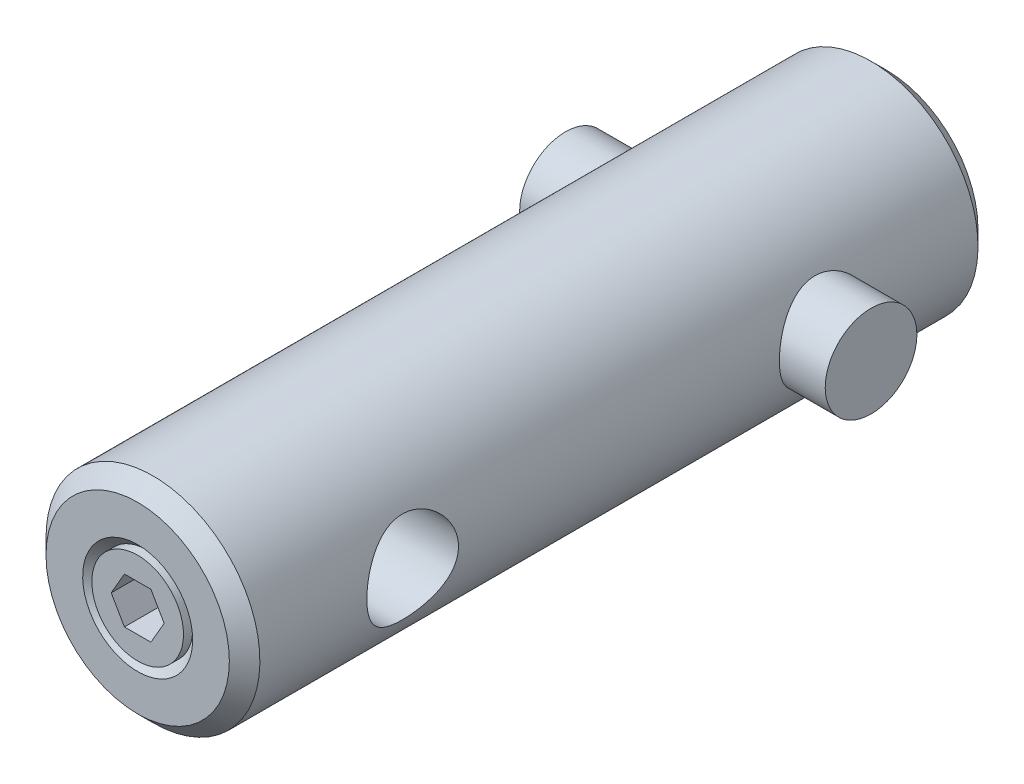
ISO-10303-21;
HEADER;
FILE_DESCRIPTION(('STEP AP214'),'2;1');
FILE_NAME('part.step','',(''),(''),'','','');
FILE_SCHEMA(('AUTOMOTIVE_DESIGN { 1 0 10303 214 1 1 1 1 }'));
ENDSEC;
DATA;
#1=APPLICATION_CONTEXT('core data for automotive mechanical design processes');
#2=APPLICATION_PROTOCOL_DEFINITION('international standard','automotive_design',2000,#1);
#3=PRODUCT_CONTEXT('',#1,'mechanical');
#4=PRODUCT('Part','Part','',(#3));
#5=PRODUCT_RELATED_PRODUCT_CATEGORY('part','',(#4));
#6=PRODUCT_DEFINITION_FORMATION('','',#4);
#7=PRODUCT_DEFINITION_CONTEXT('part definition',#1,'design');
#8=PRODUCT_DEFINITION('design','',#6,#7);
#9=PRODUCT_DEFINITION_SHAPE('','',#8);
#10=(LENGTH_UNIT() NAMED_UNIT(*) SI_UNIT(.MILLI.,.METRE.));
#11=(NAMED_UNIT(*) PLANE_ANGLE_UNIT() SI_UNIT($,.RADIAN.));
#12=(NAMED_UNIT(*) SI_UNIT($,.STERADIAN.) SOLID_ANGLE_UNIT());
#13=UNCERTAINTY_MEASURE_WITH_UNIT(LENGTH_MEASURE(1.E-05),#10,'distance_accuracy_value','');
#14=(GEOMETRIC_REPRESENTATION_CONTEXT(3) GLOBAL_UNCERTAINTY_ASSIGNED_CONTEXT((#13)) GLOBAL_UNIT_ASSIGNED_CONTEXT((#10,
#11,#12)) REPRESENTATION_CONTEXT('',''));
#15=CARTESIAN_POINT('',(0.,0.,0.));
#16=DIRECTION('',(0.,0.,1.));
#17=DIRECTION('',(1.,0.,0.));
#18=AXIS2_PLACEMENT_3D('',#15,#16,#17);
#19=CARTESIAN_POINT('',(0.,0.,1.49999999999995));
#20=DIRECTION('',(0.,0.,-1.));
#21=DIRECTION('',(1.,0.,0.));
#22=AXIS2_PLACEMENT_3D('',#19,#20,#21);
#23=CYLINDRICAL_SURFACE('',#22,1.5);
#24=CARTESIAN_POINT('',(0.,0.,5.5));
#25=DIRECTION('',(0.,0.,-1.));
#26=DIRECTION('',(1.,0.,0.));
#27=AXIS2_PLACEMENT_3D('',#24,#25,#26);
#28=CIRCLE('',#27,1.5);
#29=CARTESIAN_POINT('',(1.5,0.,5.5));
#30=VERTEX_POINT('',#29);
#31=EDGE_CURVE('E9',#30,#30,#28,.T.);
#32=ORIENTED_EDGE('',*,*,#31,.T.);
#33=EDGE_LOOP('',(#32));
#34=FACE_BOUND('',#33,.T.);
#35=CARTESIAN_POINT('',(0.,0.,5.2));
#36=DIRECTION('',(0.,0.,1.));
#37=DIRECTION('',(0.,-1.,0.));
#38=AXIS2_PLACEMENT_3D('',#35,#36,#37);
#39=CIRCLE('',#38,1.5);
#40=CARTESIAN_POINT('',(0.,-1.5,5.2));
#41=VERTEX_POINT('',#40);
#42=EDGE_CURVE('E17',#41,#41,#39,.T.);
#43=ORIENTED_EDGE('',*,*,#42,.T.);
#44=EDGE_LOOP('',(#43));
#45=FACE_BOUND('',#44,.T.);
#46=ADVANCED_FACE('F14',(#34,#45),#23,.T.);
#47=CARTESIAN_POINT('',(1.5,0.,5.5));
#48=DIRECTION('',(0.,0.,1.));
#49=DIRECTION('',(-1.,0.,0.));
#50=AXIS2_PLACEMENT_3D('',#47,#48,#49);
#51=PLANE('',#50);
#52=DIRECTION('',(0.5,0.866025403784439,0.));
#53=VECTOR('',#52,1.);
#54=CARTESIAN_POINT('',(0.43301270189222,-0.75,5.5));
#55=LINE('',#54,#53);
#56=CARTESIAN_POINT('',(0.43301270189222,-0.75,5.5));
#57=VERTEX_POINT('',#56);
#58=CARTESIAN_POINT('',(0.86602540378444,0.,5.5));
#59=VERTEX_POINT('',#58);
#60=EDGE_CURVE('E37',#57,#59,#55,.T.);
#61=ORIENTED_EDGE('',*,*,#60,.F.);
#62=DIRECTION('',(1.,0.,0.));
#63=VECTOR('',#62,1.);
#64=CARTESIAN_POINT('',(-0.43301270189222,-0.75,5.5));
#65=LINE('',#64,#63);
#66=CARTESIAN_POINT('',(-0.43301270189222,-0.75,5.5));
#67=VERTEX_POINT('',#66);
#68=EDGE_CURVE('E241',#67,#57,#65,.T.);
#69=ORIENTED_EDGE('',*,*,#68,.F.);
#70=DIRECTION('',(0.5,-0.866025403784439,0.));
#71=VECTOR('',#70,1.);
#72=CARTESIAN_POINT('',(-0.86602540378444,0.,5.5));
#73=LINE('',#72,#71);
#74=CARTESIAN_POINT('',(-0.86602540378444,0.,5.5));
#75=VERTEX_POINT('',#74);
#76=EDGE_CURVE('E265',#75,#67,#73,.T.);
#77=ORIENTED_EDGE('',*,*,#76,.F.);
#78=DIRECTION('',(-0.5,-0.866025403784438,0.));
#79=VECTOR('',#78,1.);
#80=CARTESIAN_POINT('',(-0.43301270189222,0.75,5.5));
#81=LINE('',#80,#79);
#82=CARTESIAN_POINT('',(-0.43301270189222,0.75,5.5));
#83=VERTEX_POINT('',#82);
#84=EDGE_CURVE('E262',#83,#75,#81,.T.);
#85=ORIENTED_EDGE('',*,*,#84,.F.);
#86=DIRECTION('',(-1.,0.,0.));
#87=VECTOR('',#86,1.);
#88=CARTESIAN_POINT('',(0.43301270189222,0.75,5.5));
#89=LINE('',#88,#87);
#90=CARTESIAN_POINT('',(0.43301270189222,0.75,5.5));
#91=VERTEX_POINT('',#90);
#92=EDGE_CURVE('E259',#91,#83,#89,.T.);
#93=ORIENTED_EDGE('',*,*,#92,.F.);
#94=DIRECTION('',(-0.5,0.866025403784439,0.));
#95=VECTOR('',#94,1.);
#96=CARTESIAN_POINT('',(0.86602540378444,0.,5.5));
#97=LINE('',#96,#95);
#98=EDGE_CURVE('E221',#59,#91,#97,.T.);
#99=ORIENTED_EDGE('',*,*,#98,.F.);
#100=EDGE_LOOP('',(#61,#69,#77,#85,#93,#99));
#101=FACE_BOUND('',#100,.T.);
#102=ORIENTED_EDGE('',*,*,#31,.F.);
#103=EDGE_LOOP('',(#102));
#104=FACE_BOUND('',#103,.T.);
#105=ADVANCED_FACE('F207',(#101,#104),#51,.T.);
#106=CARTESIAN_POINT('',(0.43301270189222,-0.75,3.5));
#107=DIRECTION('',(0.866025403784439,-0.5,0.));
#108=DIRECTION('',(0.5,0.866025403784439,0.));
#109=AXIS2_PLACEMENT_3D('',#106,#107,#108);
#110=PLANE('',#109);
#111=ORIENTED_EDGE('',*,*,#60,.T.);
#112=DIRECTION('',(0.,0.,1.));
#113=VECTOR('',#112,1.);
#114=CARTESIAN_POINT('',(0.86602540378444,0.,3.5));
#115=LINE('',#114,#113);
#116=CARTESIAN_POINT('',(0.86602540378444,0.,3.5));
#117=VERTEX_POINT('',#116);
#118=EDGE_CURVE('E255',#117,#59,#115,.T.);
#119=ORIENTED_EDGE('',*,*,#118,.F.);
#120=DIRECTION('',(0.5,0.866025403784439,0.));
#121=VECTOR('',#120,1.);
#122=CARTESIAN_POINT('',(0.43301270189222,-0.75,3.5));
#123=LINE('',#122,#121);
#124=CARTESIAN_POINT('',(0.43301270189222,-0.75,3.5));
#125=VERTEX_POINT('',#124);
#126=EDGE_CURVE('E237',#125,#117,#123,.T.);
#127=ORIENTED_EDGE('',*,*,#126,.F.);
#128=DIRECTION('',(0.,0.,1.));
#129=VECTOR('',#128,1.);
#130=CARTESIAN_POINT('',(0.43301270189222,-0.75,3.5));
#131=LINE('',#130,#129);
#132=EDGE_CURVE('E22',#125,#57,#131,.T.);
#133=ORIENTED_EDGE('',*,*,#132,.T.);
#134=EDGE_LOOP('',(#111,#119,#127,#133));
#135=FACE_BOUND('',#134,.T.);
#136=ADVANCED_FACE('F213',(#135),#110,.F.);
#137=CARTESIAN_POINT('',(-0.43301270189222,-0.75,3.5));
#138=DIRECTION('',(0.,-1.,0.));
#139=DIRECTION('',(1.,0.,0.));
#140=AXIS2_PLACEMENT_3D('',#137,#138,#139);
#141=PLANE('',#140);
#142=ORIENTED_EDGE('',*,*,#68,.T.);
#143=ORIENTED_EDGE('',*,*,#132,.F.);
#144=DIRECTION('',(1.,0.,0.));
#145=VECTOR('',#144,1.);
#146=CARTESIAN_POINT('',(-0.43301270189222,-0.75,3.5));
#147=LINE('',#146,#145);
#148=CARTESIAN_POINT('',(-0.43301270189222,-0.75,3.5));
#149=VERTEX_POINT('',#148);
#150=EDGE_CURVE('E253',#149,#125,#147,.T.);
#151=ORIENTED_EDGE('',*,*,#150,.F.);
#152=DIRECTION('',(0.,0.,1.));
#153=VECTOR('',#152,1.);
#154=CARTESIAN_POINT('',(-0.43301270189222,-0.75,3.5));
#155=LINE('',#154,#153);
#156=EDGE_CURVE('E271',#149,#67,#155,.T.);
#157=ORIENTED_EDGE('',*,*,#156,.T.);
#158=EDGE_LOOP('',(#142,#143,#151,#157));
#159=FACE_BOUND('',#158,.T.);
#160=ADVANCED_FACE('F297',(#159),#141,.F.);
#161=CARTESIAN_POINT('',(-0.866025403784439,0.,3.5));
#162=DIRECTION('',(-0.866025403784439,-0.5,0.));
#163=DIRECTION('',(0.5,-0.866025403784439,0.));
#164=AXIS2_PLACEMENT_3D('',#161,#162,#163);
#165=PLANE('',#164);
#166=ORIENTED_EDGE('',*,*,#76,.T.);
#167=ORIENTED_EDGE('',*,*,#156,.F.);
#168=DIRECTION('',(0.5,-0.866025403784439,0.));
#169=VECTOR('',#168,1.);
#170=CARTESIAN_POINT('',(-0.866025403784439,0.,3.5));
#171=LINE('',#170,#169);
#172=CARTESIAN_POINT('',(-0.866025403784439,0.,3.5));
#173=VERTEX_POINT('',#172);
#174=EDGE_CURVE('E250',#173,#149,#171,.T.);
#175=ORIENTED_EDGE('',*,*,#174,.F.);
#176=DIRECTION('',(0.,0.,1.));
#177=VECTOR('',#176,1.);
#178=CARTESIAN_POINT('',(-0.866025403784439,0.,3.5));
#179=LINE('',#178,#177);
#180=EDGE_CURVE('E273',#173,#75,#179,.T.);
#181=ORIENTED_EDGE('',*,*,#180,.T.);
#182=EDGE_LOOP('',(#166,#167,#175,#181));
#183=FACE_BOUND('',#182,.T.);
#184=ADVANCED_FACE('F299',(#183),#165,.F.);
#185=CARTESIAN_POINT('',(-0.43301270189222,0.75,3.5));
#186=DIRECTION('',(-0.866025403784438,0.5,0.));
#187=DIRECTION('',(-0.5,-0.866025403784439,0.));
#188=AXIS2_PLACEMENT_3D('',#185,#186,#187);
#189=PLANE('',#188);
#190=ORIENTED_EDGE('',*,*,#84,.T.);
#191=ORIENTED_EDGE('',*,*,#180,.F.);
#192=DIRECTION('',(-0.5,-0.866025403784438,0.));
#193=VECTOR('',#192,1.);
#194=CARTESIAN_POINT('',(-0.43301270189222,0.75,3.5));
#195=LINE('',#194,#193);
#196=CARTESIAN_POINT('',(-0.43301270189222,0.75,3.5));
#197=VERTEX_POINT('',#196);
#198=EDGE_CURVE('E247',#197,#173,#195,.T.);
#199=ORIENTED_EDGE('',*,*,#198,.F.);
#200=DIRECTION('',(0.,0.,1.));
#201=VECTOR('',#200,1.);
#202=CARTESIAN_POINT('',(-0.43301270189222,0.75,3.5));
#203=LINE('',#202,#201);
#204=EDGE_CURVE('E275',#197,#83,#203,.T.);
#205=ORIENTED_EDGE('',*,*,#204,.T.);
#206=EDGE_LOOP('',(#190,#191,#199,#205));
#207=FACE_BOUND('',#206,.T.);
#208=ADVANCED_FACE('F302',(#207),#189,.F.);
#209=CARTESIAN_POINT('',(0.43301270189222,0.75,3.5));
#210=DIRECTION('',(0.,1.,0.));
#211=DIRECTION('',(-1.,0.,0.));
#212=AXIS2_PLACEMENT_3D('',#209,#210,#211);
#213=PLANE('',#212);
#214=ORIENTED_EDGE('',*,*,#92,.T.);
#215=ORIENTED_EDGE('',*,*,#204,.F.);
#216=DIRECTION('',(-1.,0.,0.));
#217=VECTOR('',#216,1.);
#218=CARTESIAN_POINT('',(0.43301270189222,0.75,3.5));
#219=LINE('',#218,#217);
#220=CARTESIAN_POINT('',(0.43301270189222,0.75,3.5));
#221=VERTEX_POINT('',#220);
#222=EDGE_CURVE('E244',#221,#197,#219,.T.);
#223=ORIENTED_EDGE('',*,*,#222,.F.);
#224=DIRECTION('',(0.,0.,1.));
#225=VECTOR('',#224,1.);
#226=CARTESIAN_POINT('',(0.43301270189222,0.75,3.5));
#227=LINE('',#226,#225);
#228=EDGE_CURVE('E277',#221,#91,#227,.T.);
#229=ORIENTED_EDGE('',*,*,#228,.T.);
#230=EDGE_LOOP('',(#214,#215,#223,#229));
#231=FACE_BOUND('',#230,.T.);
#232=ADVANCED_FACE('F290',(#231),#213,.F.);
#233=CARTESIAN_POINT('',(0.86602540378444,0.,3.5));
#234=DIRECTION('',(0.866025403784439,0.5,0.));
#235=DIRECTION('',(-0.5,0.866025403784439,0.));
#236=AXIS2_PLACEMENT_3D('',#233,#234,#235);
#237=PLANE('',#236);
#238=ORIENTED_EDGE('',*,*,#98,.T.);
#239=ORIENTED_EDGE('',*,*,#228,.F.);
#240=DIRECTION('',(-0.5,0.866025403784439,0.));
#241=VECTOR('',#240,1.);
#242=CARTESIAN_POINT('',(0.86602540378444,0.,3.5));
#243=LINE('',#242,#241);
#244=EDGE_CURVE('E240',#117,#221,#243,.T.);
#245=ORIENTED_EDGE('',*,*,#244,.F.);
#246=ORIENTED_EDGE('',*,*,#118,.T.);
#247=EDGE_LOOP('',(#238,#239,#245,#246));
#248=FACE_BOUND('',#247,.T.);
#249=ADVANCED_FACE('F282',(#248),#237,.F.);
#250=CARTESIAN_POINT('',(0.86602540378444,0.,3.5));
#251=DIRECTION('',(0.,0.,1.));
#252=DIRECTION('',(0.,-1.,0.));
#253=AXIS2_PLACEMENT_3D('',#250,#251,#252);
#254=PLANE('',#253);
#255=ORIENTED_EDGE('',*,*,#126,.T.);
#256=ORIENTED_EDGE('',*,*,#244,.T.);
#257=ORIENTED_EDGE('',*,*,#222,.T.);
#258=ORIENTED_EDGE('',*,*,#198,.T.);
#259=ORIENTED_EDGE('',*,*,#174,.T.);
#260=ORIENTED_EDGE('',*,*,#150,.T.);
#261=EDGE_LOOP('',(#255,#256,#257,#258,#259,#260));
#262=FACE_BOUND('',#261,.T.);
#263=ADVANCED_FACE('F294',(#262),#254,.T.);
#264=CARTESIAN_POINT('',(-5.,0.,-13.5));
#265=DIRECTION('',(1.,0.,0.));
#266=DIRECTION('',(0.,1.,0.));
#267=AXIS2_PLACEMENT_3D('',#264,#265,#266);
#268=CYLINDRICAL_SURFACE('',#267,1.5);
#269=CARTESIAN_POINT('',(-5.,0.,-13.5));
#270=DIRECTION('',(-1.,0.,0.));
#271=DIRECTION('',(0.,-1.,0.));
#272=AXIS2_PLACEMENT_3D('',#269,#270,#271);
#273=CIRCLE('',#272,1.5);
#274=CARTESIAN_POINT('',(-5.,-1.5,-13.5));
#275=VERTEX_POINT('',#274);
#276=EDGE_CURVE('E341',#275,#275,#273,.T.);
#277=ORIENTED_EDGE('',*,*,#276,.F.);
#278=EDGE_LOOP('',(#277));
#279=FACE_BOUND('',#278,.T.);
#280=CARTESIAN_POINT('',(-3.16227766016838,1.5,-13.5));
#281=CARTESIAN_POINT('',(-3.16228717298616,1.49999038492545,-13.4202310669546));
#282=CARTESIAN_POINT('',(-3.16534018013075,1.49359660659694,-13.3403418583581));
#283=CARTESIAN_POINT('',(-3.17716042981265,1.46827542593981,-13.1828833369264));
#284=CARTESIAN_POINT('',(-3.18594276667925,1.44931491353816,-13.1053207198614));
#285=CARTESIAN_POINT('',(-3.20802619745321,1.399748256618,-12.9550840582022));
#286=CARTESIAN_POINT('',(-3.22130811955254,1.36919145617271,-12.8823908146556));
#287=CARTESIAN_POINT('',(-3.25086693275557,1.29744502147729,-12.7431820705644));
#288=CARTESIAN_POINT('',(-3.26714323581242,1.25625747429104,-12.6766653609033));
#289=CARTESIAN_POINT('',(-3.3020556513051,1.16151711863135,-12.5472750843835));
#290=CARTESIAN_POINT('',(-3.32077467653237,1.10737213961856,-12.4848572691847));
#291=CARTESIAN_POINT('',(-3.35778390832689,0.989495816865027,-12.3696486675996));
#292=CARTESIAN_POINT('',(-3.37607394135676,0.925760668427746,-12.3168617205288));
#293=CARTESIAN_POINT('',(-3.41118222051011,0.786887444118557,-12.2200404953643));
#294=CARTESIAN_POINT('',(-3.4278929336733,0.71135772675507,-12.1765254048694));
#295=CARTESIAN_POINT('',(-3.4569371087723,0.553203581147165,-12.1030178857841));
#296=CARTESIAN_POINT('',(-3.46927262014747,0.470582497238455,-12.0730191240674));
#297=CARTESIAN_POINT('',(-3.48758735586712,0.305382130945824,-12.0290674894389));
#298=CARTESIAN_POINT('',(-3.49387724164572,0.223047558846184,-12.0143269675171));
#299=CARTESIAN_POINT('',(-3.50052462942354,0.0568497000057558,-11.9987586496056));
#300=CARTESIAN_POINT('',(-3.50088468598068,-0.0270129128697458,-11.9979248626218));
#301=CARTESIAN_POINT('',(-3.49581016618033,-0.188134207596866,-12.0097951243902));
#302=CARTESIAN_POINT('',(-3.49074679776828,-0.265470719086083,-12.0216318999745));
#303=CARTESIAN_POINT('',(-3.47591102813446,-0.416935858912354,-12.0570120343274));
#304=CARTESIAN_POINT('',(-3.46613827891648,-0.491064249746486,-12.0805562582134));
#305=CARTESIAN_POINT('',(-3.44263346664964,-0.635378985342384,-12.1389532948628));
#306=CARTESIAN_POINT('',(-3.42884310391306,-0.705487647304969,-12.1739736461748));
#307=CARTESIAN_POINT('',(-3.39863837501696,-0.839017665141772,-12.2541586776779));
#308=CARTESIAN_POINT('',(-3.38222306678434,-0.902436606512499,-12.2993270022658));
#309=CARTESIAN_POINT('',(-3.34696895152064,-1.02577392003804,-12.402404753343));
#310=CARTESIAN_POINT('',(-3.32804069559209,-1.08508648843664,-12.4610094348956));
#311=CARTESIAN_POINT('',(-3.29078815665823,-1.19331308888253,-12.5873514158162));
#312=CARTESIAN_POINT('',(-3.27246413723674,-1.24222263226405,-12.655092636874));
#313=CARTESIAN_POINT('',(-3.23783417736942,-1.32993971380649,-12.8008899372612));
#314=CARTESIAN_POINT('',(-3.22162619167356,-1.36831384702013,-12.879232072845));
#315=CARTESIAN_POINT('',(-3.19424697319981,-1.43107385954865,-13.042144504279));
#316=CARTESIAN_POINT('',(-3.18307189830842,-1.4554704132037,-13.1267099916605));
#317=CARTESIAN_POINT('',(-3.16799275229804,-1.48799335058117,-13.2935863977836));
#318=CARTESIAN_POINT('',(-3.16364898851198,-1.49710640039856,-13.3756644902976));
#319=CARTESIAN_POINT('',(-3.16146494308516,-1.50171565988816,-13.5402744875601));
#320=CARTESIAN_POINT('',(-3.16362218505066,-1.49721705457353,-13.6228062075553));
#321=CARTESIAN_POINT('',(-3.17374071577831,-1.47563239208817,-13.7799312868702));
#322=CARTESIAN_POINT('',(-3.18128847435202,-1.45944230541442,-13.8546778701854));
#323=CARTESIAN_POINT('',(-3.20079786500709,-1.41614006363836,-14.0003227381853));
#324=CARTESIAN_POINT('',(-3.21276056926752,-1.38902525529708,-14.0712200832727));
#325=CARTESIAN_POINT('',(-3.24038333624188,-1.32334189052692,-14.210604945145));
#326=CARTESIAN_POINT('',(-3.25618154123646,-1.28432659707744,-14.2788536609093));
#327=CARTESIAN_POINT('',(-3.28950916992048,-1.19638562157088,-14.4081753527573));
#328=CARTESIAN_POINT('',(-3.3070393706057,-1.14745548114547,-14.4692450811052));
#329=CARTESIAN_POINT('',(-3.34369698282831,-1.03605747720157,-14.5880144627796));
#330=CARTESIAN_POINT('',(-3.36283055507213,-0.972781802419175,-14.6449576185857));
#331=CARTESIAN_POINT('',(-3.39913473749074,-0.837142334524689,-14.7475671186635));
#332=CARTESIAN_POINT('',(-3.41630515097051,-0.764777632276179,-14.7932323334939));
#333=CARTESIAN_POINT('',(-3.44690719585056,-0.612290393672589,-14.8720413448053));
#334=CARTESIAN_POINT('',(-3.46032004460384,-0.532131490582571,-14.9051225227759));
#335=CARTESIAN_POINT('',(-3.48173830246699,-0.366659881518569,-14.9570748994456));
#336=CARTESIAN_POINT('',(-3.48974713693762,-0.281350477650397,-14.9759551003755));
#337=CARTESIAN_POINT('',(-3.49904040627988,-0.114740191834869,-14.9977887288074));
#338=CARTESIAN_POINT('',(-3.50077418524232,-0.0336030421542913,-15.0018069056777));
#339=CARTESIAN_POINT('',(-3.49858700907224,0.128169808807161,-14.9967022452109));
#340=CARTESIAN_POINT('',(-3.49466715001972,0.208805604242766,-14.9875819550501));
#341=CARTESIAN_POINT('',(-3.48185611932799,0.364022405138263,-14.9572232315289));
#342=CARTESIAN_POINT('',(-3.47316550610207,0.438716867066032,-14.9364730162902));
#343=CARTESIAN_POINT('',(-3.45179100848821,0.583524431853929,-14.8839919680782));
#344=CARTESIAN_POINT('',(-3.43910638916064,0.653636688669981,-14.852259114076));
#345=CARTESIAN_POINT('',(-3.41024047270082,0.790820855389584,-14.777104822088));
#346=CARTESIAN_POINT('',(-3.39392604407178,0.857608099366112,-14.7332161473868));
#347=CARTESIAN_POINT('',(-3.35970811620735,0.983159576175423,-14.6356600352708));
#348=CARTESIAN_POINT('',(-3.34180398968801,1.04192061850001,-14.5819887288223));
#349=CARTESIAN_POINT('',(-3.30477972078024,1.15419921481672,-14.4618044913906));
#350=CARTESIAN_POINT('',(-3.28566570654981,1.20702595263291,-14.3946419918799));
#351=CARTESIAN_POINT('',(-3.24969238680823,1.30078077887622,-14.2518407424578));
#352=CARTESIAN_POINT('',(-3.23283439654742,1.34170194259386,-14.1761970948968));
#353=CARTESIAN_POINT('',(-3.20355631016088,1.41018371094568,-14.0184264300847));
#354=CARTESIAN_POINT('',(-3.19112824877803,1.43776832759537,-13.9363113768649));
#355=CARTESIAN_POINT('',(-3.17252771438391,1.47837340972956,-13.7680448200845));
#356=CARTESIAN_POINT('',(-3.16633426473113,1.49144272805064,-13.6819078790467));
#357=CARTESIAN_POINT('',(-3.16275406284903,1.49899243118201,-13.5636011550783));
#358=CARTESIAN_POINT('',(-3.16227386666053,1.50000383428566,-13.5318101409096));
#359=CARTESIAN_POINT('',(-3.16227766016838,1.5,-13.5));
#360=B_SPLINE_CURVE_WITH_KNOTS('',3,(#280,#281,#282,#283,#284,#285,#286,#287,#288,#289,#290,
#291,#292,#293,#294,#295,#296,#297,#298,#299,#300,#301,#302,#303,#304,#305,#306,#307,#308,#309,
#310,#311,#312,#313,#314,#315,#316,#317,#318,#319,#320,#321,#322,#323,#324,#325,#326,#327,#328,
#329,#330,#331,#332,#333,#334,#335,#336,#337,#338,#339,#340,#341,#342,#343,#344,#345,#346,#347,
#348,#349,#350,#351,#352,#353,#354,#355,#356,#357,#358,#359),.UNSPECIFIED.,.T.,.F.,(4,2,2,2,2,2,
2,2,2,2,2,2,2,2,2,2,2,2,2,2,2,2,2,2,2,2,2,2,2,2,2,2,2,2,2,2,2,2,2,4),(0.,0.239211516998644,
0.479055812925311,0.717890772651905,0.95667887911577,1.20974703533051,1.46291585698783,
1.7278208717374,1.992601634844,2.24290515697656,2.49310084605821,2.72720452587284,
2.96132550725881,3.19902917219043,3.43681833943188,3.69219429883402,3.94768022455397,
4.21248245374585,4.47708218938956,4.72382987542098,4.97048358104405,5.20000580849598,
5.42958381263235,5.66914358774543,5.90881132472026,6.16934837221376,6.42991150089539,
6.69175474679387,6.95343186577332,7.1959527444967,7.43842661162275,7.67141114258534,
7.90443857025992,8.14809791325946,8.39185383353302,8.6533139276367,8.91492579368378,
9.17606486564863,9.43632235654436,9.53171478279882),.UNSPECIFIED.);
#361=CARTESIAN_POINT('',(-3.16227766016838,1.5,-13.5));
#362=VERTEX_POINT('',#361);
#363=EDGE_CURVE('E224',#362,#362,#360,.T.);
#364=ORIENTED_EDGE('',*,*,#363,.F.);
#365=EDGE_LOOP('',(#364));
#366=FACE_BOUND('',#365,.T.);
#367=ADVANCED_FACE('F326',(#279,#366),#268,.T.);
#368=CARTESIAN_POINT('',(-5.,0.,-13.5));
#369=DIRECTION('',(-1.,0.,0.));
#370=DIRECTION('',(0.,-1.,0.));
#371=AXIS2_PLACEMENT_3D('',#368,#369,#370);
#372=PLANE('',#371);
#373=ORIENTED_EDGE('',*,*,#276,.T.);
#374=EDGE_LOOP('',(#373));
#375=FACE_BOUND('',#374,.T.);
#376=ADVANCED_FACE('F330',(#375),#372,.T.);
#377=CARTESIAN_POINT('',(0.,0.,5.5));
#378=DIRECTION('',(0.,0.,1.));
#379=DIRECTION('',(0.,1.,0.));
#380=AXIS2_PLACEMENT_3D('',#377,#378,#379);
#381=CONICAL_SURFACE('',#380,1.8,0.785398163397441);
#382=ORIENTED_EDGE('',*,*,#42,.F.);
#383=EDGE_LOOP('',(#382));
#384=FACE_BOUND('',#383,.T.);
#385=CARTESIAN_POINT('',(0.,0.,5.5));
#386=DIRECTION('',(0.,0.,1.));
#387=DIRECTION('',(0.,1.,0.));
#388=AXIS2_PLACEMENT_3D('',#385,#386,#387);
#389=CIRCLE('',#388,1.8);
#390=CARTESIAN_POINT('',(0.,1.8,5.5));
#391=VERTEX_POINT('',#390);
#392=EDGE_CURVE('E161',#391,#391,#389,.T.);
#393=ORIENTED_EDGE('',*,*,#392,.T.);
#394=EDGE_LOOP('',(#393));
#395=FACE_BOUND('',#394,.T.);
#396=ADVANCED_FACE('F389',(#384,#395),#381,.F.);
#397=CARTESIAN_POINT('',(0.,0.,-19.));
#398=DIRECTION('',(0.,0.,-1.));
#399=DIRECTION('',(0.,-1.,0.));
#400=AXIS2_PLACEMENT_3D('',#397,#398,#399);
#401=CONICAL_SURFACE('',#400,1.8,0.785398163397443);
#402=CARTESIAN_POINT('',(0.,0.,-18.7));
#403=DIRECTION('',(0.,0.,-1.));
#404=DIRECTION('',(0.,1.,0.));
#405=AXIS2_PLACEMENT_3D('',#402,#403,#404);
#406=CIRCLE('',#405,1.5);
#407=CARTESIAN_POINT('',(0.,1.5,-18.7));
#408=VERTEX_POINT('',#407);
#409=EDGE_CURVE('E220',#408,#408,#406,.T.);
#410=ORIENTED_EDGE('',*,*,#409,.F.);
#411=EDGE_LOOP('',(#410));
#412=FACE_BOUND('',#411,.T.);
#413=CARTESIAN_POINT('',(0.,0.,-19.));
#414=DIRECTION('',(0.,0.,-1.));
#415=DIRECTION('',(0.,-1.,0.));
#416=AXIS2_PLACEMENT_3D('',#413,#414,#415);
#417=CIRCLE('',#416,1.8);
#418=CARTESIAN_POINT('',(0.,-1.8,-19.));
#419=VERTEX_POINT('',#418);
#420=EDGE_CURVE('E164',#419,#419,#417,.T.);
#421=ORIENTED_EDGE('',*,*,#420,.T.);
#422=EDGE_LOOP('',(#421));
#423=FACE_BOUND('',#422,.T.);
#424=ADVANCED_FACE('F192',(#412,#423),#401,.F.);
#425=CARTESIAN_POINT('',(0.,0.,-19.));
#426=DIRECTION('',(0.,0.,1.));
#427=DIRECTION('',(0.,1.,0.));
#428=AXIS2_PLACEMENT_3D('',#425,#426,#427);
#429=CONICAL_SURFACE('',#428,3.,0.785398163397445);
#430=CARTESIAN_POINT('',(0.,0.,-18.5));
#431=DIRECTION('',(0.,0.,-1.));
#432=DIRECTION('',(0.,-1.,0.));
#433=AXIS2_PLACEMENT_3D('',#430,#431,#432);
#434=CIRCLE('',#433,3.5);
#435=CARTESIAN_POINT('',(0.,-3.5,-18.5));
#436=VERTEX_POINT('',#435);
#437=EDGE_CURVE('E355',#436,#436,#434,.F.);
#438=ORIENTED_EDGE('',*,*,#437,.F.);
#439=EDGE_LOOP('',(#438));
#440=FACE_BOUND('',#439,.T.);
#441=CARTESIAN_POINT('',(0.,0.,-19.));
#442=DIRECTION('',(0.,0.,-1.));
#443=DIRECTION('',(0.,-1.,0.));
#444=AXIS2_PLACEMENT_3D('',#441,#442,#443);
#445=CIRCLE('',#444,3.);
#446=CARTESIAN_POINT('',(0.,-3.,-19.));
#447=VERTEX_POINT('',#446);
#448=EDGE_CURVE('E345',#447,#447,#445,.T.);
#449=ORIENTED_EDGE('',*,*,#448,.F.);
#450=EDGE_LOOP('',(#449));
#451=FACE_BOUND('',#450,.T.);
#452=ADVANCED_FACE('F379',(#440,#451),#429,.T.);
#453=CARTESIAN_POINT('',(0.,0.,5.));
#454=DIRECTION('',(0.,0.,-1.));
#455=DIRECTION('',(0.,-1.,0.));
#456=AXIS2_PLACEMENT_3D('',#453,#454,#455);
#457=CONICAL_SURFACE('',#456,3.5,0.785398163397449);
#458=CARTESIAN_POINT('',(0.,0.,5.5));
#459=DIRECTION('',(0.,0.,-1.));
#460=DIRECTION('',(0.,-1.,0.));
#461=AXIS2_PLACEMENT_3D('',#458,#459,#460);
#462=CIRCLE('',#461,3.);
#463=CARTESIAN_POINT('',(0.,-3.,5.5));
#464=VERTEX_POINT('',#463);
#465=EDGE_CURVE('E350',#464,#464,#462,.F.);
#466=ORIENTED_EDGE('',*,*,#465,.F.);
#467=EDGE_LOOP('',(#466));
#468=FACE_BOUND('',#467,.T.);
#469=CARTESIAN_POINT('',(0.,0.,5.));
#470=DIRECTION('',(0.,0.,-1.));
#471=DIRECTION('',(0.,-1.,0.));
#472=AXIS2_PLACEMENT_3D('',#469,#470,#471);
#473=CIRCLE('',#472,3.5);
#474=CARTESIAN_POINT('',(0.,-3.5,5.));
#475=VERTEX_POINT('',#474);
#476=EDGE_CURVE('E353',#475,#475,#473,.T.);
#477=ORIENTED_EDGE('',*,*,#476,.F.);
#478=EDGE_LOOP('',(#477));
#479=FACE_BOUND('',#478,.T.);
#480=ADVANCED_FACE('F190',(#468,#479),#457,.T.);
#481=CARTESIAN_POINT('',(-3.5,0.,0.));
#482=DIRECTION('',(1.,0.,0.));
#483=DIRECTION('',(0.,0.,1.));
#484=AXIS2_PLACEMENT_3D('',#481,#482,#483);
#485=CYLINDRICAL_SURFACE('',#484,1.5);
#486=CARTESIAN_POINT('',(3.5,0.,1.49999999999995));
#487=CARTESIAN_POINT('',(3.49999299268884,0.0801521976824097,1.49999077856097));
#488=CARTESIAN_POINT('',(3.4972151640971,0.160419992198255,1.49353787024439));
#489=CARTESIAN_POINT('',(3.48637069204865,0.318671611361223,1.46796029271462));
#490=CARTESIAN_POINT('',(3.47829069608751,0.396649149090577,1.44880363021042));
#491=CARTESIAN_POINT('',(3.45770786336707,0.547768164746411,1.39866472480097));
#492=CARTESIAN_POINT('',(3.44522036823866,0.620925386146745,1.36772347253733));
#493=CARTESIAN_POINT('',(3.41702837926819,0.760936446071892,1.29506789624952));
#494=CARTESIAN_POINT('',(3.4013247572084,0.827791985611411,1.253356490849));
#495=CARTESIAN_POINT('',(3.36733908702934,0.956920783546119,1.15803614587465));
#496=CARTESIAN_POINT('',(3.34896947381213,1.01882024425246,1.10395236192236));
#497=CARTESIAN_POINT('',(3.31208827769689,1.13299518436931,0.986428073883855));
#498=CARTESIAN_POINT('',(3.29357662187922,1.18526532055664,0.922982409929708));
#499=CARTESIAN_POINT('',(3.25741027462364,1.28142843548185,0.784483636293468));
#500=CARTESIAN_POINT('',(3.23985230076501,1.32473406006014,0.708994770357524));
#501=CARTESIAN_POINT('',(3.20898084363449,1.39786599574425,0.550945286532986));
#502=CARTESIAN_POINT('',(3.19566505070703,1.42769964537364,0.468388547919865));
#503=CARTESIAN_POINT('',(3.17573899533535,1.47147459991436,0.302849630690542));
#504=CARTESIAN_POINT('',(3.16882610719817,1.48613747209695,0.22009614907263));
#505=CARTESIAN_POINT('',(3.16162424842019,1.50140303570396,0.0530370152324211));
#506=CARTESIAN_POINT('',(3.16133131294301,1.50201414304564,-0.0312676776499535));
#507=CARTESIAN_POINT('',(3.16714786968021,1.48969999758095,-0.1916499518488));
#508=CARTESIAN_POINT('',(3.17273435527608,1.47788056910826,-0.267835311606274));
#509=CARTESIAN_POINT('',(3.18879205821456,1.44290386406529,-0.417013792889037));
#510=CARTESIAN_POINT('',(3.19926427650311,1.41974426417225,-0.490006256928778));
#511=CARTESIAN_POINT('',(3.22415342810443,1.36228829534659,-0.632623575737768));
#512=CARTESIAN_POINT('',(3.23865147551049,1.32775987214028,-0.702140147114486));
#513=CARTESIAN_POINT('',(3.26994246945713,1.24871152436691,-0.834673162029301));
#514=CARTESIAN_POINT('',(3.28673634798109,1.20418753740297,-0.897686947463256));
#515=CARTESIAN_POINT('',(3.32256202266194,1.1017170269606,-1.02138875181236));
#516=CARTESIAN_POINT('',(3.34165927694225,1.04292364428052,-1.08135836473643));
#517=CARTESIAN_POINT('',(3.3786730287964,0.915936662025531,-1.19083579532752));
#518=CARTESIAN_POINT('',(3.39658921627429,0.84774060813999,-1.24034087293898));
#519=CARTESIAN_POINT('',(3.4297984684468,0.701592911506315,-1.3286219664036));
#520=CARTESIAN_POINT('',(3.44501227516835,0.623435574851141,-1.36708950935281));
#521=CARTESIAN_POINT('',(3.47048698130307,0.460939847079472,-1.43007511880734));
#522=CARTESIAN_POINT('',(3.48075078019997,0.376605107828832,-1.45460135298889));
#523=CARTESIAN_POINT('',(3.49461763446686,0.210138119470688,-1.48746693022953));
#524=CARTESIAN_POINT('',(3.49861624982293,0.128228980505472,-1.49676938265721));
#525=CARTESIAN_POINT('',(3.50077708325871,-0.0360716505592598,-1.5018147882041));
#526=CARTESIAN_POINT('',(3.49894110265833,-0.118462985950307,-1.49756192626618));
#527=CARTESIAN_POINT('',(3.48989338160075,-0.276771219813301,-1.47629218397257));
#528=CARTESIAN_POINT('',(3.48297259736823,-0.352799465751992,-1.45996583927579));
#529=CARTESIAN_POINT('',(3.46476944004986,-0.500945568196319,-1.41598955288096));
#530=CARTESIAN_POINT('',(3.45348652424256,-0.573062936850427,-1.38833820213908));
#531=CARTESIAN_POINT('',(3.42719375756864,-0.713888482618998,-1.32159942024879));
#532=CARTESIAN_POINT('',(3.41207852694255,-0.782419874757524,-1.28218183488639));
#533=CARTESIAN_POINT('',(3.37971494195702,-0.912142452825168,-1.19339052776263));
#534=CARTESIAN_POINT('',(3.36246567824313,-0.973330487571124,-1.14401255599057));
#535=CARTESIAN_POINT('',(3.32607394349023,-1.09148379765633,-1.03235520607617));
#536=CARTESIAN_POINT('',(3.30688677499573,-1.14778308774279,-0.969383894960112));
#537=CARTESIAN_POINT('',(3.26992018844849,-1.24921715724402,-0.834608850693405));
#538=CARTESIAN_POINT('',(3.25214116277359,-1.29434883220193,-0.762802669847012));
#539=CARTESIAN_POINT('',(3.21981484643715,-1.37281937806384,-0.610593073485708));
#540=CARTESIAN_POINT('',(3.20533127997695,-1.40593207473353,-0.530058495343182));
#541=CARTESIAN_POINT('',(3.18206803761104,-1.45782942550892,-0.363736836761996));
#542=CARTESIAN_POINT('',(3.17328328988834,-1.4766268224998,-0.277954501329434));
#543=CARTESIAN_POINT('',(3.16321740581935,-1.49805974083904,-0.111004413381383));
#544=CARTESIAN_POINT('',(3.16138962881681,-1.50187346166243,-0.0300203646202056));
#545=CARTESIAN_POINT('',(3.16397809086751,-1.49641325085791,0.131394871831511));
#546=CARTESIAN_POINT('',(3.16839322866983,-1.48714162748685,0.211826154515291));
#547=CARTESIAN_POINT('',(3.1824582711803,-1.45678214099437,0.365520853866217));
#548=CARTESIAN_POINT('',(3.19182357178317,-1.4363348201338,0.43893941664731));
#549=CARTESIAN_POINT('',(3.21449437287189,-1.38485117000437,0.581310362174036));
#550=CARTESIAN_POINT('',(3.22780099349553,-1.35381183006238,0.650261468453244));
#551=CARTESIAN_POINT('',(3.25787626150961,-1.27981602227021,0.78641043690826));
#552=CARTESIAN_POINT('',(3.2748083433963,-1.23624027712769,0.853234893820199));
#553=CARTESIAN_POINT('',(3.3097987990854,-1.13924888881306,0.978990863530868));
#554=CARTESIAN_POINT('',(3.32785759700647,-1.08582952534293,1.03791937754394));
#555=CARTESIAN_POINT('',(3.36477750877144,-0.965671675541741,1.15100309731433));
#556=CARTESIAN_POINT('',(3.38358948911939,-0.898214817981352,1.20441473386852));
#557=CARTESIAN_POINT('',(3.41848089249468,-0.754612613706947,1.29921492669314));
#558=CARTESIAN_POINT('',(3.43455907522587,-0.678463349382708,1.34059803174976));
#559=CARTESIAN_POINT('',(3.46197513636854,-0.520626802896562,1.40934456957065));
#560=CARTESIAN_POINT('',(3.47337868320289,-0.439036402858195,1.4369035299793));
#561=CARTESIAN_POINT('',(3.49042295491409,-0.271925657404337,1.47763471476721));
#562=CARTESIAN_POINT('',(3.49608152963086,-0.186418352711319,1.49085150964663));
#563=CARTESIAN_POINT('',(3.49952115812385,-0.0670267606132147,1.49888051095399));
#564=CARTESIAN_POINT('',(3.50000293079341,-0.0335234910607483,1.50000385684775));
#565=CARTESIAN_POINT('',(3.5,0.,1.49999999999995));
#566=B_SPLINE_CURVE_WITH_KNOTS('',3,(#486,#487,#488,#489,#490,#491,#492,#493,#494,#495,#496,
#497,#498,#499,#500,#501,#502,#503,#504,#505,#506,#507,#508,#509,#510,#511,#512,#513,#514,#515,
#516,#517,#518,#519,#520,#521,#522,#523,#524,#525,#526,#527,#528,#529,#530,#531,#532,#533,#534,
#535,#536,#537,#538,#539,#540,#541,#542,#543,#544,#545,#546,#547,#548,#549,#550,#551,#552,#553,
#554,#555,#556,#557,#558,#559,#560,#561,#562,#563,#564,#565),.UNSPECIFIED.,.T.,.F.,(4,2,2,2,2,2,
2,2,2,2,2,2,2,2,2,2,2,2,2,2,2,2,2,2,2,2,2,2,2,2,2,2,2,2,2,2,2,2,2,4),(0.,0.240357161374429,
0.481321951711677,0.721456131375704,0.961525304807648,1.21311371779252,1.46484131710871,
1.7298478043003,1.9947097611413,2.2462971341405,2.49773382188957,2.72855360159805,
2.95942069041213,3.19532704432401,3.43132944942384,3.68854918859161,3.94583619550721,
4.20973622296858,4.47348148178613,4.71978673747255,4.96601595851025,5.19915597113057,
5.4323249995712,5.67277527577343,5.91332836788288,6.172014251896,6.4307719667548,
6.69417345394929,6.95734019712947,7.19934244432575,7.44130200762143,7.6706602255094,
7.90008369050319,8.14372375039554,8.38745608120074,8.65042084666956,8.91350460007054,
9.17275427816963,9.43119596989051,9.53172485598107),.UNSPECIFIED.);
#567=CARTESIAN_POINT('',(3.5,0.,1.49999999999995));
#568=VERTEX_POINT('',#567);
#569=EDGE_CURVE('E167',#568,#568,#566,.T.);
#570=ORIENTED_EDGE('',*,*,#569,.F.);
#571=EDGE_LOOP('',(#570));
#572=FACE_BOUND('',#571,.T.);
#573=CARTESIAN_POINT('',(-3.5,0.,1.49999999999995));
#574=CARTESIAN_POINT('',(-3.49999299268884,-0.0801521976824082,1.49999077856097));
#575=CARTESIAN_POINT('',(-3.4972151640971,-0.160419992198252,1.49353787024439));
#576=CARTESIAN_POINT('',(-3.48637069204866,-0.318671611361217,1.46796029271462));
#577=CARTESIAN_POINT('',(-3.47829069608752,-0.396649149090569,1.44880363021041));
#578=CARTESIAN_POINT('',(-3.45770786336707,-0.547768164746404,1.39866472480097));
#579=CARTESIAN_POINT('',(-3.44522036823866,-0.62092538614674,1.36772347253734));
#580=CARTESIAN_POINT('',(-3.41702837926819,-0.76093644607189,1.29506789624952));
#581=CARTESIAN_POINT('',(-3.4013247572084,-0.827791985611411,1.253356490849));
#582=CARTESIAN_POINT('',(-3.36733908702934,-0.95692078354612,1.15803614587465));
#583=CARTESIAN_POINT('',(-3.34896947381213,-1.01882024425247,1.10395236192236));
#584=CARTESIAN_POINT('',(-3.3120882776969,-1.13299518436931,0.986428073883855));
#585=CARTESIAN_POINT('',(-3.29357662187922,-1.18526532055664,0.922982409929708));
#586=CARTESIAN_POINT('',(-3.25741027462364,-1.28142843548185,0.784483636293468));
#587=CARTESIAN_POINT('',(-3.23985230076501,-1.32473406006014,0.708994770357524));
#588=CARTESIAN_POINT('',(-3.2089808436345,-1.39786599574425,0.550945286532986));
#589=CARTESIAN_POINT('',(-3.19566505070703,-1.42769964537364,0.468388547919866));
#590=CARTESIAN_POINT('',(-3.17573899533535,-1.47147459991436,0.302849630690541));
#591=CARTESIAN_POINT('',(-3.16882610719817,-1.48613747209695,0.22009614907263));
#592=CARTESIAN_POINT('',(-3.16162424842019,-1.50140303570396,0.0530370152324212));
#593=CARTESIAN_POINT('',(-3.16133131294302,-1.50201414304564,-0.0312676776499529));
#594=CARTESIAN_POINT('',(-3.16714786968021,-1.48969999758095,-0.191649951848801));
#595=CARTESIAN_POINT('',(-3.17273435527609,-1.47788056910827,-0.267835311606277));
#596=CARTESIAN_POINT('',(-3.18879205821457,-1.44290386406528,-0.417013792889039));
#597=CARTESIAN_POINT('',(-3.19926427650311,-1.41974426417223,-0.490006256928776));
#598=CARTESIAN_POINT('',(-3.22415342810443,-1.36228829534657,-0.63262357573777));
#599=CARTESIAN_POINT('',(-3.23865147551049,-1.32775987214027,-0.702140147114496));
#600=CARTESIAN_POINT('',(-3.26994246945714,-1.24871152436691,-0.834673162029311));
#601=CARTESIAN_POINT('',(-3.28673634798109,-1.20418753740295,-0.897686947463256));
#602=CARTESIAN_POINT('',(-3.32256202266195,-1.10171702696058,-1.02138875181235));
#603=CARTESIAN_POINT('',(-3.34165927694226,-1.04292364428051,-1.08135836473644));
#604=CARTESIAN_POINT('',(-3.3786730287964,-0.915936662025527,-1.19083579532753));
#605=CARTESIAN_POINT('',(-3.39658921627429,-0.847740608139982,-1.24034087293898));
#606=CARTESIAN_POINT('',(-3.4297984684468,-0.701592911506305,-1.3286219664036));
#607=CARTESIAN_POINT('',(-3.44501227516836,-0.623435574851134,-1.36708950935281));
#608=CARTESIAN_POINT('',(-3.47048698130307,-0.460939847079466,-1.43007511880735));
#609=CARTESIAN_POINT('',(-3.48075078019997,-0.376605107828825,-1.45460135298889));
#610=CARTESIAN_POINT('',(-3.49461763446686,-0.210138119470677,-1.48746693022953));
#611=CARTESIAN_POINT('',(-3.49861624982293,-0.128228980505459,-1.49676938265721));
#612=CARTESIAN_POINT('',(-3.50077708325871,0.0360716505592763,-1.5018147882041));
#613=CARTESIAN_POINT('',(-3.49894110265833,0.118462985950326,-1.49756192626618));
#614=CARTESIAN_POINT('',(-3.48989338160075,0.276771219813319,-1.47629218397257));
#615=CARTESIAN_POINT('',(-3.48297259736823,0.352799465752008,-1.45996583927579));
#616=CARTESIAN_POINT('',(-3.46476944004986,0.500945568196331,-1.41598955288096));
#617=CARTESIAN_POINT('',(-3.45348652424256,0.573062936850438,-1.38833820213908));
#618=CARTESIAN_POINT('',(-3.42719375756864,0.713888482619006,-1.32159942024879));
#619=CARTESIAN_POINT('',(-3.41207852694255,0.782419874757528,-1.28218183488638));
#620=CARTESIAN_POINT('',(-3.37971494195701,0.912142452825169,-1.19339052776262));
#621=CARTESIAN_POINT('',(-3.36246567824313,0.973330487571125,-1.14401255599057));
#622=CARTESIAN_POINT('',(-3.32607394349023,1.09148379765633,-1.03235520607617));
#623=CARTESIAN_POINT('',(-3.30688677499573,1.14778308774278,-0.969383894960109));
#624=CARTESIAN_POINT('',(-3.26992018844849,1.24921715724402,-0.834608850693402));
#625=CARTESIAN_POINT('',(-3.25214116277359,1.29434883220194,-0.762802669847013));
#626=CARTESIAN_POINT('',(-3.21981484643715,1.37281937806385,-0.610593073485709));
#627=CARTESIAN_POINT('',(-3.20533127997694,1.40593207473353,-0.530058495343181));
#628=CARTESIAN_POINT('',(-3.18206803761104,1.45782942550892,-0.363736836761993));
#629=CARTESIAN_POINT('',(-3.17328328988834,1.4766268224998,-0.277954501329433));
#630=CARTESIAN_POINT('',(-3.16321740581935,1.49805974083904,-0.111004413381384));
#631=CARTESIAN_POINT('',(-3.1613896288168,1.50187346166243,-0.0300203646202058));
#632=CARTESIAN_POINT('',(-3.16397809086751,1.49641325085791,0.131394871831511));
#633=CARTESIAN_POINT('',(-3.16839322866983,1.48714162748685,0.211826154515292));
#634=CARTESIAN_POINT('',(-3.1824582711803,1.45678214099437,0.365520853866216));
#635=CARTESIAN_POINT('',(-3.19182357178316,1.4363348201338,0.438939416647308));
#636=CARTESIAN_POINT('',(-3.21449437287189,1.38485117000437,0.581310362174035));
#637=CARTESIAN_POINT('',(-3.22780099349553,1.35381183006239,0.650261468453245));
#638=CARTESIAN_POINT('',(-3.25787626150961,1.27981602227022,0.78641043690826));
#639=CARTESIAN_POINT('',(-3.2748083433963,1.23624027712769,0.853234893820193));
#640=CARTESIAN_POINT('',(-3.3097987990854,1.13924888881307,0.978990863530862));
#641=CARTESIAN_POINT('',(-3.32785759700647,1.08582952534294,1.03791937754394));
#642=CARTESIAN_POINT('',(-3.36477750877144,0.965671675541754,1.15100309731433));
#643=CARTESIAN_POINT('',(-3.38358948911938,0.898214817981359,1.20441473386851));
#644=CARTESIAN_POINT('',(-3.41848089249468,0.754612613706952,1.29921492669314));
#645=CARTESIAN_POINT('',(-3.43455907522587,0.678463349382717,1.34059803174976));
#646=CARTESIAN_POINT('',(-3.46197513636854,0.52062680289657,1.40934456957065));
#647=CARTESIAN_POINT('',(-3.47337868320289,0.4390364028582,1.4369035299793));
#648=CARTESIAN_POINT('',(-3.49042295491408,0.271925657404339,1.4776347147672));
#649=CARTESIAN_POINT('',(-3.49608152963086,0.186418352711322,1.49085150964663));
#650=CARTESIAN_POINT('',(-3.49952115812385,0.067026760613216,1.49888051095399));
#651=CARTESIAN_POINT('',(-3.50000293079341,0.033523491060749,1.50000385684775));
#652=CARTESIAN_POINT('',(-3.5,0.,1.49999999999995));
#653=B_SPLINE_CURVE_WITH_KNOTS('',3,(#573,#574,#575,#576,#577,#578,#579,#580,#581,#582,#583,
#584,#585,#586,#587,#588,#589,#590,#591,#592,#593,#594,#595,#596,#597,#598,#599,#600,#601,#602,
#603,#604,#605,#606,#607,#608,#609,#610,#611,#612,#613,#614,#615,#616,#617,#618,#619,#620,#621,
#622,#623,#624,#625,#626,#627,#628,#629,#630,#631,#632,#633,#634,#635,#636,#637,#638,#639,#640,
#641,#642,#643,#644,#645,#646,#647,#648,#649,#650,#651,#652),.UNSPECIFIED.,.T.,.F.,(4,2,2,2,2,2,
2,2,2,2,2,2,2,2,2,2,2,2,2,2,2,2,2,2,2,2,2,2,2,2,2,2,2,2,2,2,2,2,2,4),(0.,0.240357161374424,
0.481321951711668,0.7214561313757,0.961525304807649,1.21311371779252,1.46484131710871,
1.7298478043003,1.9947097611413,2.2462971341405,2.49773382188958,2.72855360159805,
2.95942069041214,3.19532704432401,3.43132944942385,3.68854918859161,3.94583619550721,
4.20973622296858,4.47348148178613,4.71978673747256,4.96601595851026,5.19915597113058,
5.4323249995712,5.67277527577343,5.91332836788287,6.172014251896,6.4307719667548,
6.69417345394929,6.95734019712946,7.19934244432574,7.44130200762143,7.6706602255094,
7.90008369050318,8.14372375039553,8.38745608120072,8.65042084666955,8.91350460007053,
9.17275427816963,9.43119596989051,9.53172485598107),.UNSPECIFIED.);
#654=CARTESIAN_POINT('',(-3.5,0.,1.49999999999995));
#655=VERTEX_POINT('',#654);
#656=EDGE_CURVE('E175',#655,#655,#653,.T.);
#657=ORIENTED_EDGE('',*,*,#656,.F.);
#658=EDGE_LOOP('',(#657));
#659=FACE_BOUND('',#658,.T.);
#660=ADVANCED_FACE('F184',(#572,#659),#485,.F.);
#661=CARTESIAN_POINT('',(0.,0.,5.5));
#662=DIRECTION('',(0.,0.,-1.));
#663=DIRECTION('',(0.,-1.,0.));
#664=AXIS2_PLACEMENT_3D('',#661,#662,#663);
#665=PLANE('',#664);
#666=ORIENTED_EDGE('',*,*,#392,.F.);
#667=EDGE_LOOP('',(#666));
#668=FACE_BOUND('',#667,.T.);
#669=ORIENTED_EDGE('',*,*,#465,.T.);
#670=EDGE_LOOP('',(#669));
#671=FACE_BOUND('',#670,.T.);
#672=ADVANCED_FACE('F189',(#668,#671),#665,.F.);
#673=CARTESIAN_POINT('',(0.,0.,-19.));
#674=DIRECTION('',(0.,0.,-1.));
#675=DIRECTION('',(0.,-1.,0.));
#676=AXIS2_PLACEMENT_3D('',#673,#674,#675);
#677=PLANE('',#676);
#678=ORIENTED_EDGE('',*,*,#420,.F.);
#679=EDGE_LOOP('',(#678));
#680=FACE_BOUND('',#679,.T.);
#681=ORIENTED_EDGE('',*,*,#448,.T.);
#682=EDGE_LOOP('',(#681));
#683=FACE_BOUND('',#682,.T.);
#684=ADVANCED_FACE('F194',(#680,#683),#677,.T.);
#685=CARTESIAN_POINT('',(0.,0.,-19.));
#686=DIRECTION('',(0.,0.,1.));
#687=DIRECTION('',(0.,1.,0.));
#688=AXIS2_PLACEMENT_3D('',#685,#686,#687);
#689=CYLINDRICAL_SURFACE('',#688,3.5);
#690=CARTESIAN_POINT('',(3.16227766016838,1.5,-13.5));
#691=CARTESIAN_POINT('',(3.16228717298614,1.49999038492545,-13.5797689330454));
#692=CARTESIAN_POINT('',(3.16534018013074,1.49359660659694,-13.6596581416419));
#693=CARTESIAN_POINT('',(3.17716042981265,1.46827542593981,-13.8171166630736));
#694=CARTESIAN_POINT('',(3.18594276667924,1.44931491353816,-13.8946792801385));
#695=CARTESIAN_POINT('',(3.20802619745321,1.399748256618,-14.0449159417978));
#696=CARTESIAN_POINT('',(3.22130811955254,1.36919145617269,-14.1176091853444));
#697=CARTESIAN_POINT('',(3.25086693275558,1.29744502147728,-14.2568179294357));
#698=CARTESIAN_POINT('',(3.26714323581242,1.25625747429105,-14.3233346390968));
#699=CARTESIAN_POINT('',(3.3020556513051,1.16151711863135,-14.4527249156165));
#700=CARTESIAN_POINT('',(3.32077467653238,1.10737213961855,-14.5151427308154));
#701=CARTESIAN_POINT('',(3.35778390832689,0.989495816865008,-14.6303513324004));
#702=CARTESIAN_POINT('',(3.37607394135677,0.925760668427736,-14.6831382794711));
#703=CARTESIAN_POINT('',(3.41118222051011,0.786887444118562,-14.7799595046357));
#704=CARTESIAN_POINT('',(3.4278929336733,0.711357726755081,-14.8234745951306));
#705=CARTESIAN_POINT('',(3.45693710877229,0.553203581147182,-14.8969821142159));
#706=CARTESIAN_POINT('',(3.46927262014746,0.470582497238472,-14.9269808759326));
#707=CARTESIAN_POINT('',(3.48758735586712,0.305382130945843,-14.9709325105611));
#708=CARTESIAN_POINT('',(3.49387724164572,0.223047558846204,-14.9856730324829));
#709=CARTESIAN_POINT('',(3.50052462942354,0.0568497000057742,-15.0012413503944));
#710=CARTESIAN_POINT('',(3.50088468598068,-0.0270129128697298,-15.0020751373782));
#711=CARTESIAN_POINT('',(3.49581016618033,-0.188134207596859,-14.9902048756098));
#712=CARTESIAN_POINT('',(3.49074679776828,-0.265470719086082,-14.9783681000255));
#713=CARTESIAN_POINT('',(3.47591102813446,-0.416935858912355,-14.9429879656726));
#714=CARTESIAN_POINT('',(3.46613827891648,-0.491064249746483,-14.9194437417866));
#715=CARTESIAN_POINT('',(3.44263346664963,-0.635378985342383,-14.8610467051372));
#716=CARTESIAN_POINT('',(3.42884310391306,-0.705487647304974,-14.8260263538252));
#717=CARTESIAN_POINT('',(3.39863837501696,-0.839017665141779,-14.7458413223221));
#718=CARTESIAN_POINT('',(3.38222306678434,-0.9024366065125,-14.7006729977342));
#719=CARTESIAN_POINT('',(3.34696895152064,-1.02577392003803,-14.597595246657));
#720=CARTESIAN_POINT('',(3.32804069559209,-1.08508648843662,-14.5389905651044));
#721=CARTESIAN_POINT('',(3.29078815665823,-1.19331308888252,-14.4126485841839));
#722=CARTESIAN_POINT('',(3.27246413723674,-1.24222263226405,-14.3449073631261));
#723=CARTESIAN_POINT('',(3.23783417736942,-1.3299397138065,-14.1991100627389));
#724=CARTESIAN_POINT('',(3.22162619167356,-1.36831384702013,-14.1207679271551));
#725=CARTESIAN_POINT('',(3.19424697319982,-1.43107385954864,-13.957855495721));
#726=CARTESIAN_POINT('',(3.18307189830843,-1.4554704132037,-13.8732900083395));
#727=CARTESIAN_POINT('',(3.16799275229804,-1.48799335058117,-13.7064136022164));
#728=CARTESIAN_POINT('',(3.16364898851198,-1.49710640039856,-13.6243355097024));
#729=CARTESIAN_POINT('',(3.16146494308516,-1.50171565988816,-13.4597255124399));
#730=CARTESIAN_POINT('',(3.16362218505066,-1.49721705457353,-13.3771937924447));
#731=CARTESIAN_POINT('',(3.17374071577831,-1.47563239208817,-13.2200687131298));
#732=CARTESIAN_POINT('',(3.18128847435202,-1.45944230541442,-13.1453221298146));
#733=CARTESIAN_POINT('',(3.20079786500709,-1.41614006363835,-12.9996772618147));
#734=CARTESIAN_POINT('',(3.21276056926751,-1.38902525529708,-12.9287799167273));
#735=CARTESIAN_POINT('',(3.24038333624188,-1.32334189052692,-12.789395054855));
#736=CARTESIAN_POINT('',(3.25618154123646,-1.28432659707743,-12.7211463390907));
#737=CARTESIAN_POINT('',(3.28950916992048,-1.19638562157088,-12.5918246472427));
#738=CARTESIAN_POINT('',(3.3070393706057,-1.14745548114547,-12.5307549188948));
#739=CARTESIAN_POINT('',(3.34369698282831,-1.03605747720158,-12.4119855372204));
#740=CARTESIAN_POINT('',(3.36283055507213,-0.972781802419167,-12.3550423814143));
#741=CARTESIAN_POINT('',(3.39913473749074,-0.837142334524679,-12.2524328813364));
#742=CARTESIAN_POINT('',(3.41630515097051,-0.764777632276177,-12.2067676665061));
#743=CARTESIAN_POINT('',(3.44690719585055,-0.61229039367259,-12.1279586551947));
#744=CARTESIAN_POINT('',(3.46032004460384,-0.532131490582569,-12.0948774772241));
#745=CARTESIAN_POINT('',(3.481738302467,-0.366659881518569,-12.0429251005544));
#746=CARTESIAN_POINT('',(3.48974713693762,-0.281350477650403,-12.0240448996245));
#747=CARTESIAN_POINT('',(3.49904040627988,-0.11474019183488,-12.0022112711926));
#748=CARTESIAN_POINT('',(3.50077418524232,-0.0336030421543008,-11.9981930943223));
#749=CARTESIAN_POINT('',(3.49858700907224,0.128169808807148,-12.0032977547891));
#750=CARTESIAN_POINT('',(3.49466715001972,0.20880560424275,-12.0124180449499));
#751=CARTESIAN_POINT('',(3.48185611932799,0.364022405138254,-12.0427767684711));
#752=CARTESIAN_POINT('',(3.47316550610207,0.438716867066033,-12.0635269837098));
#753=CARTESIAN_POINT('',(3.45179100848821,0.58352443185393,-12.1160080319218));
#754=CARTESIAN_POINT('',(3.43910638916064,0.653636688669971,-12.1477408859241));
#755=CARTESIAN_POINT('',(3.41024047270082,0.790820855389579,-12.222895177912));
#756=CARTESIAN_POINT('',(3.39392604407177,0.857608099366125,-12.2667838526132));
#757=CARTESIAN_POINT('',(3.35970811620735,0.983159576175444,-12.3643399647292));
#758=CARTESIAN_POINT('',(3.341803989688,1.04192061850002,-12.4180112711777));
#759=CARTESIAN_POINT('',(3.30477972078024,1.15419921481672,-12.5381955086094));
#760=CARTESIAN_POINT('',(3.2856657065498,1.20702595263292,-12.6053580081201));
#761=CARTESIAN_POINT('',(3.24969238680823,1.30078077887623,-12.7481592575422));
#762=CARTESIAN_POINT('',(3.23283439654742,1.34170194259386,-12.8238029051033));
#763=CARTESIAN_POINT('',(3.20355631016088,1.41018371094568,-12.9815735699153));
#764=CARTESIAN_POINT('',(3.19112824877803,1.43776832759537,-13.0636886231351));
#765=CARTESIAN_POINT('',(3.17252771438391,1.47837340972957,-13.2319551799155));
#766=CARTESIAN_POINT('',(3.16633426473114,1.49144272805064,-13.3180921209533));
#767=CARTESIAN_POINT('',(3.16275406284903,1.49899243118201,-13.4363988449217));
#768=CARTESIAN_POINT('',(3.16227386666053,1.50000383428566,-13.4681898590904));
#769=CARTESIAN_POINT('',(3.16227766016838,1.5,-13.5));
#770=B_SPLINE_CURVE_WITH_KNOTS('',3,(#690,#691,#692,#693,#694,#695,#696,#697,#698,#699,#700,
#701,#702,#703,#704,#705,#706,#707,#708,#709,#710,#711,#712,#713,#714,#715,#716,#717,#718,#719,
#720,#721,#722,#723,#724,#725,#726,#727,#728,#729,#730,#731,#732,#733,#734,#735,#736,#737,#738,
#739,#740,#741,#742,#743,#744,#745,#746,#747,#748,#749,#750,#751,#752,#753,#754,#755,#756,#757,
#758,#759,#760,#761,#762,#763,#764,#765,#766,#767,#768,#769),.UNSPECIFIED.,.T.,.F.,(4,2,2,2,2,2,
2,2,2,2,2,2,2,2,2,2,2,2,2,2,2,2,2,2,2,2,2,2,2,2,2,2,2,2,2,2,2,2,2,4),(0.,0.239211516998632,
0.479055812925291,0.71789077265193,0.956678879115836,1.20974703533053,1.46291585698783,
1.72782087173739,1.99260163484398,2.24290515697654,2.4931008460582,2.72720452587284,
2.96132550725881,3.19902917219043,3.43681833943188,3.69219429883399,3.9476802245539,
4.21248245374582,4.47708218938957,4.723829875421,4.97048358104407,5.20000580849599,
5.42958381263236,5.66914358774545,5.90881132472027,6.16934837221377,6.4299115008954,
6.69175474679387,6.95343186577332,7.1959527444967,7.43842661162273,7.67141114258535,
7.90443857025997,8.14809791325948,8.391853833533,8.65331392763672,8.91492579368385,
9.17606486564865,9.43632235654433,9.53171478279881),.UNSPECIFIED.);
#771=CARTESIAN_POINT('',(3.16227766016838,1.5,-13.5));
#772=VERTEX_POINT('',#771);
#773=EDGE_CURVE('E229',#772,#772,#770,.T.);
#774=ORIENTED_EDGE('',*,*,#773,.T.);
#775=EDGE_LOOP('',(#774));
#776=FACE_BOUND('',#775,.T.);
#777=ORIENTED_EDGE('',*,*,#363,.T.);
#778=EDGE_LOOP('',(#777));
#779=FACE_BOUND('',#778,.T.);
#780=ORIENTED_EDGE('',*,*,#476,.T.);
#781=EDGE_LOOP('',(#780));
#782=FACE_BOUND('',#781,.T.);
#783=ORIENTED_EDGE('',*,*,#437,.T.);
#784=EDGE_LOOP('',(#783));
#785=FACE_BOUND('',#784,.T.);
#786=ORIENTED_EDGE('',*,*,#656,.T.);
#787=EDGE_LOOP('',(#786));
#788=FACE_BOUND('',#787,.T.);
#789=ORIENTED_EDGE('',*,*,#569,.T.);
#790=EDGE_LOOP('',(#789));
#791=FACE_BOUND('',#790,.T.);
#792=ADVANCED_FACE('F180',(#776,#779,#782,#785,#788,#791),#689,.T.);
#793=CARTESIAN_POINT('',(5.,0.,-13.5));
#794=DIRECTION('',(-1.,0.,0.));
#795=DIRECTION('',(0.,-1.,0.));
#796=AXIS2_PLACEMENT_3D('',#793,#794,#795);
#797=PLANE('',#796);
#798=CARTESIAN_POINT('',(5.,0.,-13.5));
#799=DIRECTION('',(-1.,0.,0.));
#800=DIRECTION('',(0.,-1.,0.));
#801=AXIS2_PLACEMENT_3D('',#798,#799,#800);
#802=CIRCLE('',#801,1.5);
#803=CARTESIAN_POINT('',(5.,-1.5,-13.5));
#804=VERTEX_POINT('',#803);
#805=EDGE_CURVE('E342',#804,#804,#802,.T.);
#806=ORIENTED_EDGE('',*,*,#805,.F.);
#807=EDGE_LOOP('',(#806));
#808=FACE_BOUND('',#807,.T.);
#809=ADVANCED_FACE('F333',(#808),#797,.F.);
#810=ORIENTED_EDGE('',*,*,#805,.T.);
#811=EDGE_LOOP('',(#810));
#812=FACE_BOUND('',#811,.T.);
#813=ORIENTED_EDGE('',*,*,#773,.F.);
#814=EDGE_LOOP('',(#813));
#815=FACE_BOUND('',#814,.T.);
#816=ADVANCED_FACE('F332',(#812,#815),#268,.T.);
#817=CARTESIAN_POINT('',(0.,0.,-15.));
#818=DIRECTION('',(0.,0.,1.));
#819=DIRECTION('',(-1.,0.,0.));
#820=AXIS2_PLACEMENT_3D('',#817,#818,#819);
#821=CYLINDRICAL_SURFACE('',#820,1.5);
#822=CARTESIAN_POINT('',(0.,0.,-19.));
#823=DIRECTION('',(0.,0.,1.));
#824=DIRECTION('',(-1.,0.,0.));
#825=AXIS2_PLACEMENT_3D('',#822,#823,#824);
#826=CIRCLE('',#825,1.5);
#827=CARTESIAN_POINT('',(-1.5,0.,-19.));
#828=VERTEX_POINT('',#827);
#829=EDGE_CURVE('E151',#828,#828,#826,.T.);
#830=ORIENTED_EDGE('',*,*,#829,.T.);
#831=EDGE_LOOP('',(#830));
#832=FACE_BOUND('',#831,.T.);
#833=ORIENTED_EDGE('',*,*,#409,.T.);
#834=EDGE_LOOP('',(#833));
#835=FACE_BOUND('',#834,.T.);
#836=ADVANCED_FACE('F406',(#832,#835),#821,.T.);
#837=CARTESIAN_POINT('',(-1.5,0.,-19.));
#838=DIRECTION('',(0.,0.,-1.));
#839=DIRECTION('',(1.,0.,0.));
#840=AXIS2_PLACEMENT_3D('',#837,#838,#839);
#841=PLANE('',#840);
#842=DIRECTION('',(-0.5,0.866025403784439,0.));
#843=VECTOR('',#842,1.);
#844=CARTESIAN_POINT('',(-0.433012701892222,-0.75,-19.));
#845=LINE('',#844,#843);
#846=CARTESIAN_POINT('',(-0.433012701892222,-0.75,-19.));
#847=VERTEX_POINT('',#846);
#848=CARTESIAN_POINT('',(-0.866025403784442,0.,-19.));
#849=VERTEX_POINT('',#848);
#850=EDGE_CURVE('E110',#847,#849,#845,.T.);
#851=ORIENTED_EDGE('',*,*,#850,.F.);
#852=DIRECTION('',(-1.,0.,0.));
#853=VECTOR('',#852,1.);
#854=CARTESIAN_POINT('',(0.433012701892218,-0.75,-19.));
#855=LINE('',#854,#853);
#856=CARTESIAN_POINT('',(0.433012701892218,-0.75,-19.));
#857=VERTEX_POINT('',#856);
#858=EDGE_CURVE('E125',#857,#847,#855,.T.);
#859=ORIENTED_EDGE('',*,*,#858,.F.);
#860=DIRECTION('',(-0.5,-0.866025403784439,0.));
#861=VECTOR('',#860,1.);
#862=CARTESIAN_POINT('',(0.866025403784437,0.,-19.));
#863=LINE('',#862,#861);
#864=CARTESIAN_POINT('',(0.866025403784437,0.,-19.));
#865=VERTEX_POINT('',#864);
#866=EDGE_CURVE('E128',#865,#857,#863,.T.);
#867=ORIENTED_EDGE('',*,*,#866,.F.);
#868=DIRECTION('',(0.5,-0.866025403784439,0.));
#869=VECTOR('',#868,1.);
#870=CARTESIAN_POINT('',(0.433012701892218,0.75,-19.));
#871=LINE('',#870,#869);
#872=CARTESIAN_POINT('',(0.433012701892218,0.75,-19.));
#873=VERTEX_POINT('',#872);
#874=EDGE_CURVE('E144',#873,#865,#871,.T.);
#875=ORIENTED_EDGE('',*,*,#874,.F.);
#876=DIRECTION('',(1.,0.,0.));
#877=VECTOR('',#876,1.);
#878=CARTESIAN_POINT('',(-0.433012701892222,0.75,-19.));
#879=LINE('',#878,#877);
#880=CARTESIAN_POINT('',(-0.433012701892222,0.75,-19.));
#881=VERTEX_POINT('',#880);
#882=EDGE_CURVE('E141',#881,#873,#879,.T.);
#883=ORIENTED_EDGE('',*,*,#882,.F.);
#884=DIRECTION('',(0.5,0.866025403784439,0.));
#885=VECTOR('',#884,1.);
#886=CARTESIAN_POINT('',(-0.866025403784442,0.,-19.));
#887=LINE('',#886,#885);
#888=EDGE_CURVE('E139',#849,#881,#887,.T.);
#889=ORIENTED_EDGE('',*,*,#888,.F.);
#890=EDGE_LOOP('',(#851,#859,#867,#875,#883,#889));
#891=FACE_BOUND('',#890,.T.);
#892=ORIENTED_EDGE('',*,*,#829,.F.);
#893=EDGE_LOOP('',(#892));
#894=FACE_BOUND('',#893,.T.);
#895=ADVANCED_FACE('F409',(#891,#894),#841,.T.);
#896=CARTESIAN_POINT('',(-0.433012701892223,-0.75,-17.));
#897=DIRECTION('',(-0.866025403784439,-0.5,0.));
#898=DIRECTION('',(-0.5,0.866025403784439,0.));
#899=AXIS2_PLACEMENT_3D('',#896,#897,#898);
#900=PLANE('',#899);
#901=ORIENTED_EDGE('',*,*,#850,.T.);
#902=DIRECTION('',(0.,0.,-1.));
#903=VECTOR('',#902,1.);
#904=CARTESIAN_POINT('',(-0.866025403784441,0.,-17.));
#905=LINE('',#904,#903);
#906=CARTESIAN_POINT('',(-0.866025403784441,0.,-17.));
#907=VERTEX_POINT('',#906);
#908=EDGE_CURVE('E103',#907,#849,#905,.T.);
#909=ORIENTED_EDGE('',*,*,#908,.F.);
#910=DIRECTION('',(-0.5,0.866025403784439,0.));
#911=VECTOR('',#910,1.);
#912=CARTESIAN_POINT('',(-0.433012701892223,-0.75,-17.));
#913=LINE('',#912,#911);
#914=CARTESIAN_POINT('',(-0.433012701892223,-0.75,-17.));
#915=VERTEX_POINT('',#914);
#916=EDGE_CURVE('E107',#915,#907,#913,.T.);
#917=ORIENTED_EDGE('',*,*,#916,.F.);
#918=DIRECTION('',(0.,0.,-1.));
#919=VECTOR('',#918,1.);
#920=CARTESIAN_POINT('',(-0.433012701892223,-0.75,-17.));
#921=LINE('',#920,#919);
#922=EDGE_CURVE('E149',#915,#847,#921,.T.);
#923=ORIENTED_EDGE('',*,*,#922,.T.);
#924=EDGE_LOOP('',(#901,#909,#917,#923));
#925=FACE_BOUND('',#924,.T.);
#926=ADVANCED_FACE('F105',(#925),#900,.F.);
#927=CARTESIAN_POINT('',(0.433012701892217,-0.75,-17.));
#928=DIRECTION('',(0.,-1.,0.));
#929=DIRECTION('',(-1.,0.,0.));
#930=AXIS2_PLACEMENT_3D('',#927,#928,#929);
#931=PLANE('',#930);
#932=ORIENTED_EDGE('',*,*,#858,.T.);
#933=ORIENTED_EDGE('',*,*,#922,.F.);
#934=DIRECTION('',(-1.,0.,0.));
#935=VECTOR('',#934,1.);
#936=CARTESIAN_POINT('',(0.433012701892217,-0.75,-17.));
#937=LINE('',#936,#935);
#938=CARTESIAN_POINT('',(0.433012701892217,-0.75,-17.));
#939=VERTEX_POINT('',#938);
#940=EDGE_CURVE('E115',#939,#915,#937,.T.);
#941=ORIENTED_EDGE('',*,*,#940,.F.);
#942=DIRECTION('',(0.,0.,-1.));
#943=VECTOR('',#942,1.);
#944=CARTESIAN_POINT('',(0.433012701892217,-0.75,-17.));
#945=LINE('',#944,#943);
#946=EDGE_CURVE('E152',#939,#857,#945,.T.);
#947=ORIENTED_EDGE('',*,*,#946,.T.);
#948=EDGE_LOOP('',(#932,#933,#941,#947));
#949=FACE_BOUND('',#948,.T.);
#950=ADVANCED_FACE('F416',(#949),#931,.F.);
#951=CARTESIAN_POINT('',(0.866025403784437,0.,-17.));
#952=DIRECTION('',(0.866025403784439,-0.5,0.));
#953=DIRECTION('',(-0.5,-0.866025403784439,0.));
#954=AXIS2_PLACEMENT_3D('',#951,#952,#953);
#955=PLANE('',#954);
#956=ORIENTED_EDGE('',*,*,#866,.T.);
#957=ORIENTED_EDGE('',*,*,#946,.F.);
#958=DIRECTION('',(-0.5,-0.866025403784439,0.));
#959=VECTOR('',#958,1.);
#960=CARTESIAN_POINT('',(0.866025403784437,0.,-17.));
#961=LINE('',#960,#959);
#962=CARTESIAN_POINT('',(0.866025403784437,0.,-17.));
#963=VERTEX_POINT('',#962);
#964=EDGE_CURVE('E135',#963,#939,#961,.T.);
#965=ORIENTED_EDGE('',*,*,#964,.F.);
#966=DIRECTION('',(0.,0.,-1.));
#967=VECTOR('',#966,1.);
#968=CARTESIAN_POINT('',(0.866025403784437,0.,-17.));
#969=LINE('',#968,#967);
#970=EDGE_CURVE('E154',#963,#865,#969,.T.);
#971=ORIENTED_EDGE('',*,*,#970,.T.);
#972=EDGE_LOOP('',(#956,#957,#965,#971));
#973=FACE_BOUND('',#972,.T.);
#974=ADVANCED_FACE('F425',(#973),#955,.F.);
#975=CARTESIAN_POINT('',(0.433012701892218,0.75,-17.));
#976=DIRECTION('',(0.866025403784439,0.5,0.));
#977=DIRECTION('',(0.5,-0.866025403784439,0.));
#978=AXIS2_PLACEMENT_3D('',#975,#976,#977);
#979=PLANE('',#978);
#980=ORIENTED_EDGE('',*,*,#874,.T.);
#981=ORIENTED_EDGE('',*,*,#970,.F.);
#982=DIRECTION('',(0.5,-0.866025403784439,0.));
#983=VECTOR('',#982,1.);
#984=CARTESIAN_POINT('',(0.433012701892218,0.75,-17.));
#985=LINE('',#984,#983);
#986=CARTESIAN_POINT('',(0.433012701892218,0.75,-17.));
#987=VERTEX_POINT('',#986);
#988=EDGE_CURVE('E132',#987,#963,#985,.T.);
#989=ORIENTED_EDGE('',*,*,#988,.F.);
#990=DIRECTION('',(0.,0.,-1.));
#991=VECTOR('',#990,1.);
#992=CARTESIAN_POINT('',(0.433012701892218,0.75,-17.));
#993=LINE('',#992,#991);
#994=EDGE_CURVE('E156',#987,#873,#993,.T.);
#995=ORIENTED_EDGE('',*,*,#994,.T.);
#996=EDGE_LOOP('',(#980,#981,#989,#995));
#997=FACE_BOUND('',#996,.T.);
#998=ADVANCED_FACE('F422',(#997),#979,.F.);
#999=CARTESIAN_POINT('',(-0.433012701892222,0.75,-17.));
#1000=DIRECTION('',(0.,1.,0.));
#1001=DIRECTION('',(1.,0.,0.));
#1002=AXIS2_PLACEMENT_3D('',#999,#1000,#1001);
#1003=PLANE('',#1002);
#1004=ORIENTED_EDGE('',*,*,#882,.T.);
#1005=ORIENTED_EDGE('',*,*,#994,.F.);
#1006=DIRECTION('',(1.,0.,0.));
#1007=VECTOR('',#1006,1.);
#1008=CARTESIAN_POINT('',(-0.433012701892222,0.75,-17.));
#1009=LINE('',#1008,#1007);
#1010=CARTESIAN_POINT('',(-0.433012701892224,0.75,-17.));
#1011=VERTEX_POINT('',#1010);
#1012=EDGE_CURVE('E29',#1011,#987,#1009,.T.);
#1013=ORIENTED_EDGE('',*,*,#1012,.F.);
#1014=DIRECTION('',(0.,0.,-1.));
#1015=VECTOR('',#1014,1.);
#1016=CARTESIAN_POINT('',(-0.433012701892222,0.75,-17.));
#1017=LINE('',#1016,#1015);
#1018=EDGE_CURVE('E114',#1011,#881,#1017,.T.);
#1019=ORIENTED_EDGE('',*,*,#1018,.T.);
#1020=EDGE_LOOP('',(#1004,#1005,#1013,#1019));
#1021=FACE_BOUND('',#1020,.T.);
#1022=ADVANCED_FACE('F419',(#1021),#1003,.F.);
#1023=CARTESIAN_POINT('',(-0.866025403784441,0.,-17.));
#1024=DIRECTION('',(-0.866025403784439,0.5,0.));
#1025=DIRECTION('',(0.5,0.866025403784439,0.));
#1026=AXIS2_PLACEMENT_3D('',#1023,#1024,#1025);
#1027=PLANE('',#1026);
#1028=ORIENTED_EDGE('',*,*,#888,.T.);
#1029=ORIENTED_EDGE('',*,*,#1018,.F.);
#1030=DIRECTION('',(0.5,0.866025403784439,0.));
#1031=VECTOR('',#1030,1.);
#1032=CARTESIAN_POINT('',(-0.866025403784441,0.,-17.));
#1033=LINE('',#1032,#1031);
#1034=EDGE_CURVE('E118',#907,#1011,#1033,.T.);
#1035=ORIENTED_EDGE('',*,*,#1034,.F.);
#1036=ORIENTED_EDGE('',*,*,#908,.T.);
#1037=EDGE_LOOP('',(#1028,#1029,#1035,#1036));
#1038=FACE_BOUND('',#1037,.T.);
#1039=ADVANCED_FACE('F119',(#1038),#1027,.F.);
#1040=CARTESIAN_POINT('',(0.,0.,-17.));
#1041=DIRECTION('',(0.,0.,-1.));
#1042=DIRECTION('',(0.,1.,0.));
#1043=AXIS2_PLACEMENT_3D('',#1040,#1041,#1042);
#1044=PLANE('',#1043);
#1045=ORIENTED_EDGE('',*,*,#940,.T.);
#1046=ORIENTED_EDGE('',*,*,#916,.T.);
#1047=ORIENTED_EDGE('',*,*,#1034,.T.);
#1048=ORIENTED_EDGE('',*,*,#1012,.T.);
#1049=ORIENTED_EDGE('',*,*,#988,.T.);
#1050=ORIENTED_EDGE('',*,*,#964,.T.);
#1051=EDGE_LOOP('',(#1045,#1046,#1047,#1048,#1049,#1050));
#1052=FACE_BOUND('',#1051,.T.);
#1053=ADVANCED_FACE('F122',(#1052),#1044,.T.);
#1054=CLOSED_SHELL('',(#46,#105,#136,#160,#184,#208,#232,#249,#263,#367,#376,#396,#424,#452,
#480,#660,#672,#684,#792,#809,#816,#836,#895,#926,#950,#974,#998,#1022,#1039,#1053));
#1055=MANIFOLD_SOLID_BREP('B1',#1054);
#1056=ADVANCED_BREP_SHAPE_REPRESENTATION('',(#18,#1055),#14);
#1057=SHAPE_DEFINITION_REPRESENTATION(#9,#1056);
ENDSEC;
END-ISO-10303-21;
